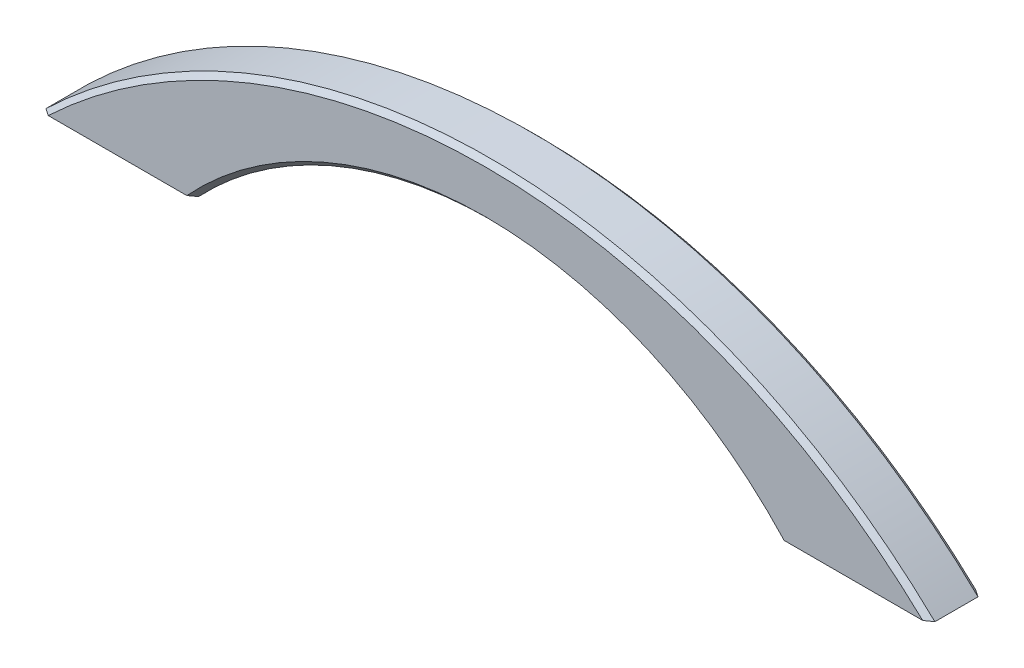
from build123d import *

# Parameters (mm, degrees)
EXTRUDE_1_DEPTH = 4
M4X0_7_1_D      = 3.3
M4X0_7_1_DEPTH  = 6
M4X0_7_1_TIP    = 0.991420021
CHAMFER_1_SIZE  = 0.75


with BuildPart() as part:
    # Sketch 1 → Extrude 1 (new, symmetric)
    with BuildSketch(Plane.XY):
        with BuildLine():
            Line((-44, 0), (-67, 0))
            ThreePointArc((-67, 0), (0, 27), (67, 0))
            Line((67, 0), (44, 0))
            ThreePointArc((44, 0), (0, 19), (-44, 0))
        make_face()
    extrude(amount=EXTRUDE_1_DEPTH, both=True)

    # M4x0.7 _1
    with Locations(Plane(origin=(0, 0, 0), x_dir=(-1, 0, 0), z_dir=(0, -1, 0))):
        with Locations((50, 0), (-50, 0)):
            Hole(M4X0_7_1_D / 2, depth=M4X0_7_1_DEPTH)
            with Locations((0, 0, -(M4X0_7_1_DEPTH + M4X0_7_1_TIP / 2))):  # 118° drill point
                Cone(0, M4X0_7_1_D / 2, M4X0_7_1_TIP, mode=Mode.SUBTRACT)

    # Chamfer 1
    chamfer_1_edges = [part.edges().sort_by_distance(p)[0] for p in [
        (0, 27, 4),
        (0, 19, 4),
        (0, 27, -4),
        (0, 19, -4),
    ]]
    chamfer(chamfer_1_edges, length=CHAMFER_1_SIZE)


solid = part.part
